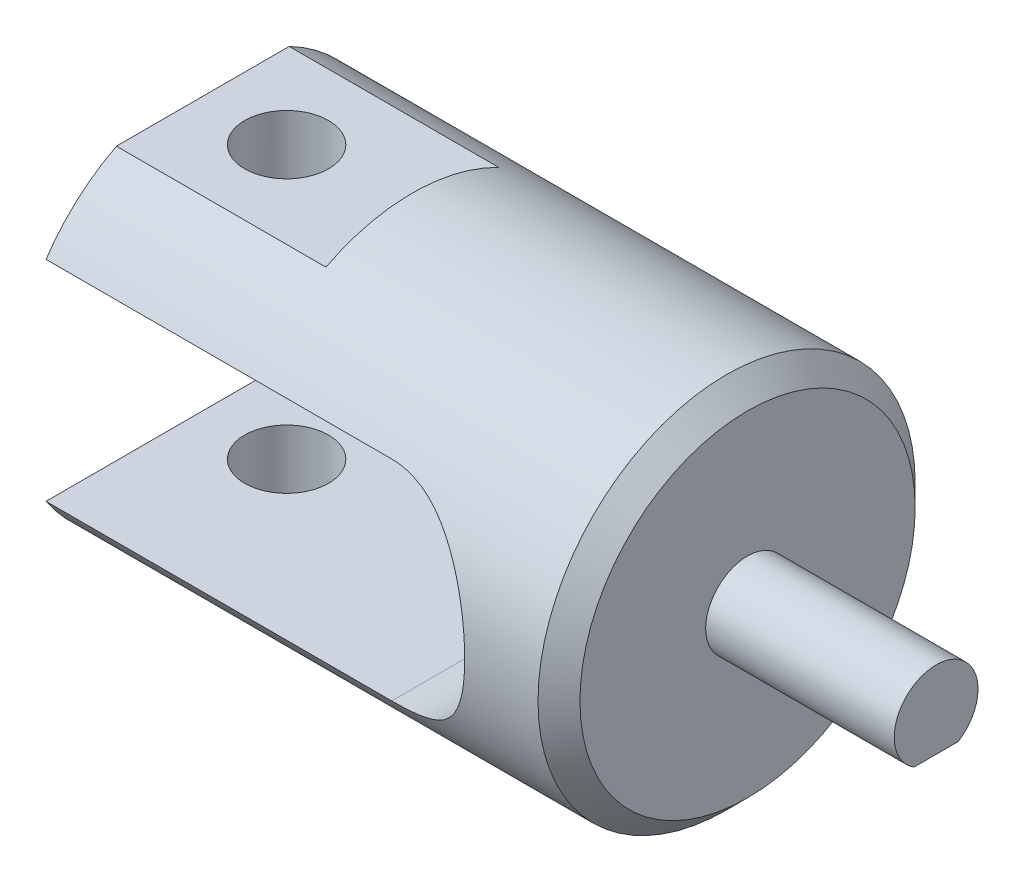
from build123d import *

# Parameters (mm, degrees)
SMUSSO1_SIZE                  = 1
TAGLIO_ESTRUSIONE3_DEPTH      = 9
TAGLIO_ESTRUSIONE3_DEPTH_BACK = 9
TAGLIO_ESTRUSIONE4_DEPTH      = 9
TAGLIO_ESTRUSIONE4_DEPTH_BACK = 9
SCHIZZO6_W                    = 10
SCHIZZO6_H                    = 1
SCHIZZO6_W_2                  = 7
SCHIZZO6_H_2                  = 0.3
TAGLIO_ESTRUSIONE5_START      = 8
SCHIZZO7_R                    = 2
TAGLIO_ESTRUSIONE5_DEPTH      = 16


with BuildPart() as part:
    # Schizzo1 → Rivoluzione1 (revolve)
    with BuildSketch(Plane.XY, mode=Mode.PRIVATE) as rivoluzione1_sk:
        Polygon((-46.137890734, 0), (-46.137890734, 9), (-20.137890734, 9), (-20.137890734, 2), (-11.137890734, 2), (-11.137890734, 0), align=None)
    revolve(rivoluzione1_sk.sketch.rotate(Axis((-64.542721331, 0, 0), (1, 0, 0)), 90), axis=Axis((-64.542721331, 0, 0), (1, 0, 0)))

    # Smusso1
    smusso1_edges = [part.edges().sort_by_distance(p)[0] for p in [
        (-20.137890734, 0, -9),
    ]]
    chamfer(smusso1_edges, length=SMUSSO1_SIZE)

    # Schizzo5 → Taglio-Estrusione3 (cut, two sides: drawn at the far end of the back side and taken through both)
    with BuildSketch(Plane.XY.offset(-TAGLIO_ESTRUSIONE3_DEPTH_BACK)):
        with BuildLine():
            Line((-46.137890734, 5), (-29.637890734, 5))
            ThreePointArc((-29.637890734, 5), (-24.637890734, 0), (-29.637890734, -5))
            Line((-29.637890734, -5), (-46.137890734, -5))
            ThreePointArc((-46.137890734, -5), (-51.137890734, 0), (-46.137890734, 5))
        make_face()
    extrude(amount=TAGLIO_ESTRUSIONE3_DEPTH + TAGLIO_ESTRUSIONE3_DEPTH_BACK, mode=Mode.SUBTRACT)

    # Schizzo6 → Taglio-Estrusione4 (cut, two sides: drawn at the far end of the back side and taken through both)
    with BuildSketch(Plane.XY.offset(-TAGLIO_ESTRUSIONE4_DEPTH_BACK)):
        with Locations((-41.137890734, 8.5)):
            Rectangle(SCHIZZO6_W, SCHIZZO6_H)
        with Locations((-41.137890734, -8.5)):
            Rectangle(SCHIZZO6_W, SCHIZZO6_H)
        with Locations((-14.637890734, -1.85)):
            Rectangle(SCHIZZO6_W_2, SCHIZZO6_H_2)
    extrude(amount=TAGLIO_ESTRUSIONE4_DEPTH + TAGLIO_ESTRUSIONE4_DEPTH_BACK, mode=Mode.SUBTRACT)

    # Schizzo7 → Taglio-Estrusione5 (cut)
    with BuildSketch(Plane(origin=(0, 0, 0), x_dir=(1, 0, 0), z_dir=(0, 1, 0)).offset(TAGLIO_ESTRUSIONE5_START)):
        with Locations(Location((-42.137890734, 0, 0), (0, 0, 180))):
            Circle(SCHIZZO7_R)
    extrude(amount=-TAGLIO_ESTRUSIONE5_DEPTH, mode=Mode.SUBTRACT)


solid = part.part
